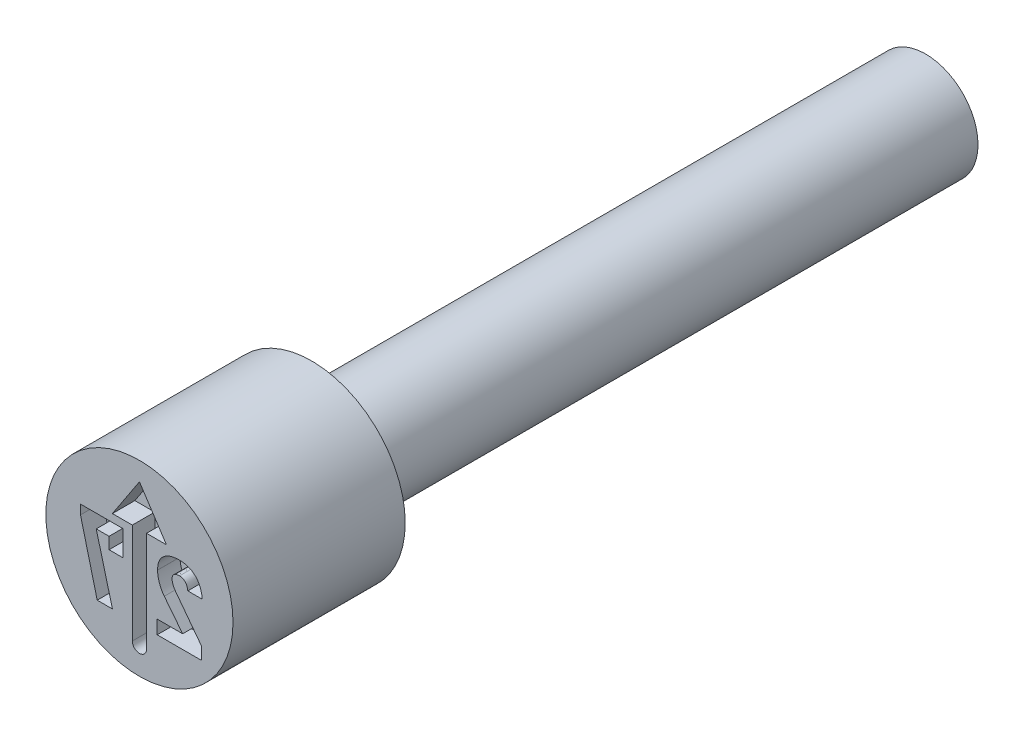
ISO-10303-21;
HEADER;
FILE_DESCRIPTION(('STEP AP214'),'2;1');
FILE_NAME('part.step','',(''),(''),'','','');
FILE_SCHEMA(('AUTOMOTIVE_DESIGN { 1 0 10303 214 1 1 1 1 }'));
ENDSEC;
DATA;
#1=APPLICATION_CONTEXT('core data for automotive mechanical design processes');
#2=APPLICATION_PROTOCOL_DEFINITION('international standard','automotive_design',2000,#1);
#3=PRODUCT_CONTEXT('',#1,'mechanical');
#4=PRODUCT('Part','Part','',(#3));
#5=PRODUCT_RELATED_PRODUCT_CATEGORY('part','',(#4));
#6=PRODUCT_DEFINITION_FORMATION('','',#4);
#7=PRODUCT_DEFINITION_CONTEXT('part definition',#1,'design');
#8=PRODUCT_DEFINITION('design','',#6,#7);
#9=PRODUCT_DEFINITION_SHAPE('','',#8);
#10=(LENGTH_UNIT() NAMED_UNIT(*) SI_UNIT(.MILLI.,.METRE.));
#11=(NAMED_UNIT(*) PLANE_ANGLE_UNIT() SI_UNIT($,.RADIAN.));
#12=(NAMED_UNIT(*) SI_UNIT($,.STERADIAN.) SOLID_ANGLE_UNIT());
#13=UNCERTAINTY_MEASURE_WITH_UNIT(LENGTH_MEASURE(1.E-05),#10,'distance_accuracy_value','');
#14=(GEOMETRIC_REPRESENTATION_CONTEXT(3) GLOBAL_UNCERTAINTY_ASSIGNED_CONTEXT((#13)) GLOBAL_UNIT_ASSIGNED_CONTEXT((#10,
#11,#12)) REPRESENTATION_CONTEXT('',''));
#15=CARTESIAN_POINT('',(0.,0.,0.));
#16=DIRECTION('',(0.,0.,1.));
#17=DIRECTION('',(1.,0.,0.));
#18=AXIS2_PLACEMENT_3D('',#15,#16,#17);
#19=CARTESIAN_POINT('',(0.,0.7,-2.3));
#20=DIRECTION('',(0.,0.,1.));
#21=DIRECTION('',(1.,0.,0.));
#22=AXIS2_PLACEMENT_3D('',#19,#20,#21);
#23=PLANE('',#22);
#24=CARTESIAN_POINT('',(0.,0.,-2.3));
#25=DIRECTION('',(0.,0.,1.));
#26=DIRECTION('',(1.,0.,0.));
#27=AXIS2_PLACEMENT_3D('',#24,#25,#26);
#28=CIRCLE('',#27,1.25);
#29=CARTESIAN_POINT('',(1.25,0.,-2.3));
#30=VERTEX_POINT('',#29);
#31=EDGE_CURVE('E11',#30,#30,#28,.T.);
#32=ORIENTED_EDGE('',*,*,#31,.F.);
#33=EDGE_LOOP('',(#32));
#34=FACE_BOUND('',#33,.T.);
#35=CARTESIAN_POINT('',(0.,0.,-2.3));
#36=DIRECTION('',(0.,0.,1.));
#37=DIRECTION('',(1.,0.,0.));
#38=AXIS2_PLACEMENT_3D('',#35,#36,#37);
#39=CIRCLE('',#38,0.7);
#40=CARTESIAN_POINT('',(0.7,0.,-2.3));
#41=VERTEX_POINT('',#40);
#42=EDGE_CURVE('E430',#41,#41,#39,.T.);
#43=ORIENTED_EDGE('',*,*,#42,.T.);
#44=EDGE_LOOP('',(#43));
#45=FACE_BOUND('',#44,.T.);
#46=ADVANCED_FACE('F39',(#34,#45),#23,.F.);
#47=CARTESIAN_POINT('',(0.,0.,-0.403888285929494));
#48=DIRECTION('',(0.,0.,1.));
#49=DIRECTION('',(1.,0.,0.));
#50=AXIS2_PLACEMENT_3D('',#47,#48,#49);
#51=CYLINDRICAL_SURFACE('',#50,1.25);
#52=CARTESIAN_POINT('',(0.,0.,0.));
#53=DIRECTION('',(0.,0.,1.));
#54=DIRECTION('',(1.,0.,0.));
#55=AXIS2_PLACEMENT_3D('',#52,#53,#54);
#56=CIRCLE('',#55,1.25);
#57=CARTESIAN_POINT('',(1.25,0.,0.));
#58=VERTEX_POINT('',#57);
#59=EDGE_CURVE('E46',#58,#58,#56,.T.);
#60=ORIENTED_EDGE('',*,*,#59,.F.);
#61=EDGE_LOOP('',(#60));
#62=FACE_BOUND('',#61,.T.);
#63=ORIENTED_EDGE('',*,*,#31,.T.);
#64=EDGE_LOOP('',(#63));
#65=FACE_BOUND('',#64,.T.);
#66=ADVANCED_FACE('F415',(#62,#65),#51,.T.);
#67=CARTESIAN_POINT('',(0.,1.25,0.));
#68=DIRECTION('',(0.,0.,-1.));
#69=DIRECTION('',(-1.,0.,0.));
#70=AXIS2_PLACEMENT_3D('',#67,#68,#69);
#71=PLANE('',#70);
#72=DIRECTION('',(0.,-1.,0.));
#73=VECTOR('',#72,1.);
#74=CARTESIAN_POINT('',(-0.787045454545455,0.35,0.));
#75=LINE('',#74,#73);
#76=CARTESIAN_POINT('',(-0.787045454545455,0.35,0.));
#77=VERTEX_POINT('',#76);
#78=CARTESIAN_POINT('',(-0.787045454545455,0.224594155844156,0.));
#79=VERTEX_POINT('',#78);
#80=EDGE_CURVE('E297',#77,#79,#75,.T.);
#81=ORIENTED_EDGE('',*,*,#80,.F.);
#82=DIRECTION('',(-1.,0.,0.));
#83=VECTOR('',#82,1.);
#84=CARTESIAN_POINT('',(-0.218051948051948,0.35,0.));
#85=LINE('',#84,#83);
#86=CARTESIAN_POINT('',(-0.218051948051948,0.35,0.));
#87=VERTEX_POINT('',#86);
#88=EDGE_CURVE('E53',#87,#77,#85,.T.);
#89=ORIENTED_EDGE('',*,*,#88,.F.);
#90=DIRECTION('',(0.,1.,0.));
#91=VECTOR('',#90,1.);
#92=CARTESIAN_POINT('',(-0.218051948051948,0.0123376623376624,0.));
#93=LINE('',#92,#91);
#94=CARTESIAN_POINT('',(-0.218051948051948,0.0123376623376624,0.));
#95=VERTEX_POINT('',#94);
#96=EDGE_CURVE('E274',#95,#87,#93,.T.);
#97=ORIENTED_EDGE('',*,*,#96,.F.);
#98=DIRECTION('',(1.,0.,0.));
#99=VECTOR('',#98,1.);
#100=CARTESIAN_POINT('',(-0.40575487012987,0.0123376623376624,0.));
#101=LINE('',#100,#99);
#102=CARTESIAN_POINT('',(-0.40575487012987,0.0123376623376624,0.));
#103=VERTEX_POINT('',#102);
#104=EDGE_CURVE('E277',#103,#95,#101,.T.);
#105=ORIENTED_EDGE('',*,*,#104,.F.);
#106=DIRECTION('',(0.,-1.,0.));
#107=VECTOR('',#106,1.);
#108=CARTESIAN_POINT('',(-0.40575487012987,0.168181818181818,0.));
#109=LINE('',#108,#107);
#110=CARTESIAN_POINT('',(-0.40575487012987,0.168181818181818,0.));
#111=VERTEX_POINT('',#110);
#112=EDGE_CURVE('E311',#111,#103,#109,.T.);
#113=ORIENTED_EDGE('',*,*,#112,.F.);
#114=DIRECTION('',(1.,0.,0.));
#115=VECTOR('',#114,1.);
#116=CARTESIAN_POINT('',(-0.576818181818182,0.168181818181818,0.));
#117=LINE('',#116,#115);
#118=CARTESIAN_POINT('',(-0.576818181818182,0.168181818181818,0.));
#119=VERTEX_POINT('',#118);
#120=EDGE_CURVE('E308',#119,#111,#117,.T.);
#121=ORIENTED_EDGE('',*,*,#120,.F.);
#122=DIRECTION('',(-0.255602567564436,0.966781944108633,0.));
#123=VECTOR('',#122,1.);
#124=CARTESIAN_POINT('',(-0.360503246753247,-0.65,0.));
#125=LINE('',#124,#123);
#126=CARTESIAN_POINT('',(-0.360503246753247,-0.65,0.));
#127=VERTEX_POINT('',#126);
#128=EDGE_CURVE('E305',#127,#119,#125,.T.);
#129=ORIENTED_EDGE('',*,*,#128,.F.);
#130=DIRECTION('',(1.,0.,0.));
#131=VECTOR('',#130,1.);
#132=CARTESIAN_POINT('',(-0.563831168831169,-0.65,0.));
#133=LINE('',#132,#131);
#134=CARTESIAN_POINT('',(-0.563831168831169,-0.65,0.));
#135=VERTEX_POINT('',#134);
#136=EDGE_CURVE('E302',#135,#127,#133,.T.);
#137=ORIENTED_EDGE('',*,*,#136,.F.);
#138=DIRECTION('',(0.247293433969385,-0.968940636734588,0.));
#139=VECTOR('',#138,1.);
#140=CARTESIAN_POINT('',(-0.787045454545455,0.224594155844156,0.));
#141=LINE('',#140,#139);
#142=EDGE_CURVE('E299',#79,#135,#141,.T.);
#143=ORIENTED_EDGE('',*,*,#142,.F.);
#144=EDGE_LOOP('',(#81,#89,#97,#105,#113,#121,#129,#137,#143));
#145=FACE_BOUND('',#144,.T.);
#146=DIRECTION('',(0.,1.,0.));
#147=VECTOR('',#146,1.);
#148=CARTESIAN_POINT('',(0.825933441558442,-0.65,0.));
#149=LINE('',#148,#147);
#150=CARTESIAN_POINT('',(0.825933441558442,-0.65,0.));
#151=VERTEX_POINT('',#150);
#152=CARTESIAN_POINT('',(0.825933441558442,-0.479951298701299,0.));
#153=VERTEX_POINT('',#152);
#154=EDGE_CURVE('E602',#151,#153,#149,.T.);
#155=ORIENTED_EDGE('',*,*,#154,.F.);
#156=DIRECTION('',(1.,0.,0.));
#157=VECTOR('',#156,1.);
#158=CARTESIAN_POINT('',(0.237053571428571,-0.65,0.));
#159=LINE('',#158,#157);
#160=CARTESIAN_POINT('',(0.237053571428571,-0.65,0.));
#161=VERTEX_POINT('',#160);
#162=EDGE_CURVE('E61',#161,#151,#159,.T.);
#163=ORIENTED_EDGE('',*,*,#162,.F.);
#164=DIRECTION('',(0.,-1.,0.));
#165=VECTOR('',#164,1.);
#166=CARTESIAN_POINT('',(0.237053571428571,-0.468181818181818,0.));
#167=LINE('',#166,#165);
#168=CARTESIAN_POINT('',(0.237053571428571,-0.468181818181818,0.));
#169=VERTEX_POINT('',#168);
#170=EDGE_CURVE('E335',#169,#161,#167,.T.);
#171=ORIENTED_EDGE('',*,*,#170,.F.);
#172=DIRECTION('',(-1.,0.,0.));
#173=VECTOR('',#172,1.);
#174=CARTESIAN_POINT('',(0.577353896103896,-0.468181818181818,0.));
#175=LINE('',#174,#173);
#176=CARTESIAN_POINT('',(0.577353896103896,-0.468181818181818,0.));
#177=VERTEX_POINT('',#176);
#178=EDGE_CURVE('E530',#177,#169,#175,.T.);
#179=ORIENTED_EDGE('',*,*,#178,.F.);
#180=DIRECTION('',(0.618183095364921,-0.78603413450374,0.));
#181=VECTOR('',#180,1.);
#182=CARTESIAN_POINT('',(0.332224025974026,-0.156493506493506,0.));
#183=LINE('',#182,#181);
#184=CARTESIAN_POINT('',(0.332224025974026,-0.156493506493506,0.));
#185=VERTEX_POINT('',#184);
#186=EDGE_CURVE('E533',#185,#177,#183,.T.);
#187=ORIENTED_EDGE('',*,*,#186,.F.);
#188=CARTESIAN_POINT('',(0.242532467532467,0.100811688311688,0.));
#189=CARTESIAN_POINT('',(0.242791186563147,0.0894335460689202,0.));
#190=CARTESIAN_POINT('',(0.24330908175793,0.0666571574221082,0.));
#191=CARTESIAN_POINT('',(0.247983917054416,0.0325691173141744,0.));
#192=CARTESIAN_POINT('',(0.255517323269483,-0.00134488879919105,0.));
#193=CARTESIAN_POINT('',(0.265863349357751,-0.0349210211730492,0.));
#194=CARTESIAN_POINT('',(0.278715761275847,-0.067577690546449,0.));
#195=CARTESIAN_POINT('',(0.294141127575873,-0.0988676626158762,0.));
#196=CARTESIAN_POINT('',(0.311550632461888,-0.128804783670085,0.));
#197=CARTESIAN_POINT('',(0.325346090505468,-0.147281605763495,0.));
#198=CARTESIAN_POINT('',(0.332224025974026,-0.156493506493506,0.));
#199=B_SPLINE_CURVE_WITH_KNOTS('',3,(#188,#189,#190,#191,#192,#193,#194,#195,#196,#197,#198),
.UNSPECIFIED.,.F.,.F.,(4,1,1,1,1,1,1,1,4),(0.,0.123046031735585,0.246309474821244,
0.371480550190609,0.498560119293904,0.626024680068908,0.750715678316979,0.875715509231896,1.),.UNSPECIFIED.);
#200=CARTESIAN_POINT('',(0.242532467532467,0.100811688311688,0.));
#201=VERTEX_POINT('',#200);
#202=EDGE_CURVE('E536',#201,#185,#199,.T.);
#203=ORIENTED_EDGE('',*,*,#202,.F.);
#204=DIRECTION('',(0.,-1.,0.));
#205=VECTOR('',#204,1.);
#206=CARTESIAN_POINT('',(0.242532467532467,0.101623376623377,0.));
#207=LINE('',#206,#205);
#208=CARTESIAN_POINT('',(0.242532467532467,0.101623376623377,0.));
#209=VERTEX_POINT('',#208);
#210=EDGE_CURVE('E541',#209,#201,#207,.T.);
#211=ORIENTED_EDGE('',*,*,#210,.F.);
#212=CARTESIAN_POINT('',(0.536972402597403,0.362987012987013,0.));
#213=CARTESIAN_POINT('',(0.525599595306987,0.362825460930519,0.));
#214=CARTESIAN_POINT('',(0.503480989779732,0.362511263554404,0.));
#215=CARTESIAN_POINT('',(0.471280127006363,0.359119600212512,0.));
#216=CARTESIAN_POINT('',(0.440982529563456,0.354000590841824,0.));
#217=CARTESIAN_POINT('',(0.412636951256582,0.346511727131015,0.));
#218=CARTESIAN_POINT('',(0.38635718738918,0.336743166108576,0.));
#219=CARTESIAN_POINT('',(0.36206451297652,0.324964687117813,0.));
#220=CARTESIAN_POINT('',(0.339708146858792,0.311075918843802,0.));
#221=CARTESIAN_POINT('',(0.319459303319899,0.295047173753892,0.));
#222=CARTESIAN_POINT('',(0.301240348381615,0.277169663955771,0.));
#223=CARTESIAN_POINT('',(0.285558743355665,0.257261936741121,0.));
#224=CARTESIAN_POINT('',(0.271983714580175,0.235726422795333,0.));
#225=CARTESIAN_POINT('',(0.261372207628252,0.212145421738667,0.));
#226=CARTESIAN_POINT('',(0.25263596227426,0.187073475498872,0.));
#227=CARTESIAN_POINT('',(0.246979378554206,0.160061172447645,0.));
#228=CARTESIAN_POINT('',(0.243167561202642,0.131426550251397,0.));
#229=CARTESIAN_POINT('',(0.242747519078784,0.111715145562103,0.));
#230=CARTESIAN_POINT('',(0.242532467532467,0.101623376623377,0.));
#231=B_SPLINE_CURVE_WITH_KNOTS('',3,(#212,#213,#214,#215,#216,#217,#218,#219,#220,#221,#222,
#223,#224,#225,#226,#227,#228,#229,#230),.UNSPECIFIED.,.F.,.F.,(4,1,1,1,1,1,1,1,1,1,1,1,1,1,1,1,
4),(0.,0.0762312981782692,0.148259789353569,0.216860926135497,0.28210063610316,
0.344528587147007,0.404571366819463,0.462840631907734,0.520642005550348,0.577409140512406,
0.633580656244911,0.690215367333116,0.747647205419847,0.806597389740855,0.867894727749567,
0.932365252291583,1.),.UNSPECIFIED.);
#232=CARTESIAN_POINT('',(0.536972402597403,0.362987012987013,0.));
#233=VERTEX_POINT('',#232);
#234=EDGE_CURVE('E547',#233,#209,#231,.T.);
#235=ORIENTED_EDGE('',*,*,#234,.F.);
#236=CARTESIAN_POINT('',(0.838311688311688,0.0628652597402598,0.));
#237=CARTESIAN_POINT('',(0.837362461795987,0.0744566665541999,0.));
#238=CARTESIAN_POINT('',(0.835509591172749,0.0970828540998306,0.));
#239=CARTESIAN_POINT('',(0.829435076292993,0.129812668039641,0.));
#240=CARTESIAN_POINT('',(0.821584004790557,0.16064191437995,0.));
#241=CARTESIAN_POINT('',(0.8115963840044,0.189564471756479,0.));
#242=CARTESIAN_POINT('',(0.798762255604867,0.21624544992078,0.));
#243=CARTESIAN_POINT('',(0.784342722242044,0.241242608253,0.));
#244=CARTESIAN_POINT('',(0.766999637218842,0.263782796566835,0.));
#245=CARTESIAN_POINT('',(0.748015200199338,0.284620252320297,0.));
#246=CARTESIAN_POINT('',(0.726869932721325,0.302973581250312,0.));
#247=CARTESIAN_POINT('',(0.704323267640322,0.319163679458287,0.));
#248=CARTESIAN_POINT('',(0.680034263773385,0.332636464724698,0.));
#249=CARTESIAN_POINT('',(0.654372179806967,0.343812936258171,0.));
#250=CARTESIAN_POINT('',(0.627052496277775,0.352295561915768,0.));
#251=CARTESIAN_POINT('',(0.598432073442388,0.358649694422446,0.));
#252=CARTESIAN_POINT('',(0.568182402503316,0.362314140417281,0.));
#253=CARTESIAN_POINT('',(0.547534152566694,0.362759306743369,0.));
#254=CARTESIAN_POINT('',(0.536972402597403,0.362987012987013,0.));
#255=B_SPLINE_CURVE_WITH_KNOTS('',3,(#236,#237,#238,#239,#240,#241,#242,#243,#244,#245,#246,
#247,#248,#249,#250,#251,#252,#253,#254),.UNSPECIFIED.,.F.,.F.,(4,1,1,1,1,1,1,1,1,1,1,1,1,1,1,1,
4),(0.,0.0733268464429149,0.143132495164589,0.209679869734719,0.273918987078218,
0.33576228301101,0.396210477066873,0.45560885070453,0.514796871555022,0.573764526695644,
0.631900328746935,0.689592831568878,0.748648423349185,0.808163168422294,0.86976604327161,
0.933384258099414,1.),.UNSPECIFIED.);
#256=CARTESIAN_POINT('',(0.838311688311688,0.0628652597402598,0.));
#257=VERTEX_POINT('',#256);
#258=EDGE_CURVE('E552',#257,#233,#255,.T.);
#259=ORIENTED_EDGE('',*,*,#258,.F.);
#260=DIRECTION('',(0.,1.,0.));
#261=VECTOR('',#260,1.);
#262=CARTESIAN_POINT('',(0.838311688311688,0.0622564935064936,0.));
#263=LINE('',#262,#261);
#264=CARTESIAN_POINT('',(0.838311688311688,0.0622564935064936,0.));
#265=VERTEX_POINT('',#264);
#266=EDGE_CURVE('E560',#265,#257,#263,.T.);
#267=ORIENTED_EDGE('',*,*,#266,.F.);
#268=DIRECTION('',(1.,0.,0.));
#269=VECTOR('',#268,1.);
#270=CARTESIAN_POINT('',(0.645941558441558,0.0622564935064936,0.));
#271=LINE('',#270,#269);
#272=CARTESIAN_POINT('',(0.645941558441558,0.0622564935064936,0.));
#273=VERTEX_POINT('',#272);
#274=EDGE_CURVE('E566',#273,#265,#271,.T.);
#275=ORIENTED_EDGE('',*,*,#274,.F.);
#276=DIRECTION('',(0.,-1.,0.));
#277=VECTOR('',#276,1.);
#278=CARTESIAN_POINT('',(0.645941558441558,0.0628652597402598,0.));
#279=LINE('',#278,#277);
#280=CARTESIAN_POINT('',(0.645941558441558,0.0628652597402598,0.));
#281=VERTEX_POINT('',#280);
#282=EDGE_CURVE('E569',#281,#273,#279,.T.);
#283=ORIENTED_EDGE('',*,*,#282,.F.);
#284=CARTESIAN_POINT('',(0.535551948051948,0.181168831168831,0.));
#285=CARTESIAN_POINT('',(0.542903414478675,0.180881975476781,0.));
#286=CARTESIAN_POINT('',(0.557187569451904,0.180324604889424,0.));
#287=CARTESIAN_POINT('',(0.577409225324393,0.174147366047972,0.));
#288=CARTESIAN_POINT('',(0.595630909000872,0.164457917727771,0.));
#289=CARTESIAN_POINT('',(0.611339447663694,0.150632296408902,0.));
#290=CARTESIAN_POINT('',(0.624347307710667,0.133273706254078,0.));
#291=CARTESIAN_POINT('',(0.63490444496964,0.112832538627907,0.));
#292=CARTESIAN_POINT('',(0.642074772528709,0.0889397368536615,0.));
#293=CARTESIAN_POINT('',(0.644611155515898,0.0718364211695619,0.));
#294=CARTESIAN_POINT('',(0.645941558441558,0.0628652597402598,0.));
#295=B_SPLINE_CURVE_WITH_KNOTS('',3,(#284,#285,#286,#287,#288,#289,#290,#291,#292,#293,#294),
.UNSPECIFIED.,.F.,.F.,(4,1,1,1,1,1,1,1,4),(0.,0.122603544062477,0.238222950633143,
0.350089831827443,0.465559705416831,0.58502806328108,0.711014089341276,0.848418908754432,1.),.UNSPECIFIED.);
#296=CARTESIAN_POINT('',(0.535551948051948,0.181168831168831,0.));
#297=VERTEX_POINT('',#296);
#298=EDGE_CURVE('E572',#297,#281,#295,.T.);
#299=ORIENTED_EDGE('',*,*,#298,.F.);
#300=CARTESIAN_POINT('',(0.435714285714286,0.0963474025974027,0.));
#301=CARTESIAN_POINT('',(0.435991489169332,0.102741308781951,0.));
#302=CARTESIAN_POINT('',(0.436522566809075,0.1149910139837,0.));
#303=CARTESIAN_POINT('',(0.441526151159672,0.132251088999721,0.));
#304=CARTESIAN_POINT('',(0.449726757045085,0.147281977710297,0.));
#305=CARTESIAN_POINT('',(0.461472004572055,0.159697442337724,0.));
#306=CARTESIAN_POINT('',(0.476093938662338,0.169517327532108,0.));
#307=CARTESIAN_POINT('',(0.493589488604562,0.17643778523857,0.));
#308=CARTESIAN_POINT('',(0.513729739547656,0.180406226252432,0.));
#309=CARTESIAN_POINT('',(0.528025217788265,0.180905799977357,0.));
#310=CARTESIAN_POINT('',(0.535551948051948,0.181168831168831,0.));
#311=B_SPLINE_CURVE_WITH_KNOTS('',3,(#300,#301,#302,#303,#304,#305,#306,#307,#308,#309,#310),
.UNSPECIFIED.,.F.,.F.,(4,1,1,1,1,1,1,1,4),(0.,0.128749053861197,0.246662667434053,
0.359069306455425,0.47107757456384,0.588039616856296,0.711712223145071,0.848213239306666,1.),.UNSPECIFIED.);
#312=CARTESIAN_POINT('',(0.435714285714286,0.0963474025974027,0.));
#313=VERTEX_POINT('',#312);
#314=EDGE_CURVE('E577',#313,#297,#311,.T.);
#315=ORIENTED_EDGE('',*,*,#314,.F.);
#316=DIRECTION('',(0.,1.,0.));
#317=VECTOR('',#316,1.);
#318=CARTESIAN_POINT('',(0.435714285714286,0.0949269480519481,0.));
#319=LINE('',#318,#317);
#320=CARTESIAN_POINT('',(0.435714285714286,0.0949269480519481,0.));
#321=VERTEX_POINT('',#320);
#322=EDGE_CURVE('E585',#321,#313,#319,.T.);
#323=ORIENTED_EDGE('',*,*,#322,.F.);
#324=CARTESIAN_POINT('',(0.484212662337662,-0.0272321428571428,0.));
#325=CARTESIAN_POINT('',(0.477055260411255,-0.0171469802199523,0.));
#326=CARTESIAN_POINT('',(0.463109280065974,0.00250365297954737,0.));
#327=CARTESIAN_POINT('',(0.450487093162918,0.029489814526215,0.));
#328=CARTESIAN_POINT('',(0.442623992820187,0.0506473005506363,0.));
#329=CARTESIAN_POINT('',(0.438876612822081,0.0659906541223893,0.));
#330=CARTESIAN_POINT('',(0.436203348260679,0.0806296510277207,0.));
#331=CARTESIAN_POINT('',(0.435874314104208,0.0902486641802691,0.));
#332=CARTESIAN_POINT('',(0.435714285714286,0.0949269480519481,0.));
#333=B_SPLINE_CURVE_WITH_KNOTS('',3,(#324,#325,#326,#327,#328,#329,#330,#331,#332),
.UNSPECIFIED.,.F.,.F.,(4,1,1,1,1,1,4),(0.,0.277375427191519,0.540457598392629,0.666416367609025,
0.784009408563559,0.894951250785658,1.),.UNSPECIFIED.);
#334=CARTESIAN_POINT('',(0.484212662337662,-0.0272321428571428,0.));
#335=VERTEX_POINT('',#334);
#336=EDGE_CURVE('E591',#335,#321,#333,.T.);
#337=ORIENTED_EDGE('',*,*,#336,.F.);
#338=DIRECTION('',(-0.602458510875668,0.798150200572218,0.));
#339=VECTOR('',#338,1.);
#340=CARTESIAN_POINT('',(0.825933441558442,-0.479951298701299,0.));
#341=LINE('',#340,#339);
#342=EDGE_CURVE('E596',#153,#335,#341,.T.);
#343=ORIENTED_EDGE('',*,*,#342,.F.);
#344=EDGE_LOOP('',(#155,#163,#171,#179,#187,#203,#211,#235,#259,#267,#275,#283,#299,#315,#323,
#337,#343));
#345=FACE_BOUND('',#344,.T.);
#346=DIRECTION('',(0.,1.,0.));
#347=VECTOR('',#346,1.);
#348=CARTESIAN_POINT('',(0.0952365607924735,0.453175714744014,0.));
#349=LINE('',#348,#347);
#350=CARTESIAN_POINT('',(0.0952365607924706,-0.888080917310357,0.));
#351=VERTEX_POINT('',#350);
#352=CARTESIAN_POINT('',(0.0952365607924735,0.453175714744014,0.));
#353=VERTEX_POINT('',#352);
#354=EDGE_CURVE('E469',#351,#353,#349,.T.);
#355=ORIENTED_EDGE('',*,*,#354,.F.);
#356=CARTESIAN_POINT('',(0.,-0.888080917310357,0.));
#357=DIRECTION('',(0.,0.,1.));
#358=DIRECTION('',(1.,0.,0.));
#359=AXIS2_PLACEMENT_3D('',#356,#357,#358);
#360=CIRCLE('',#359,0.0952365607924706);
#361=CARTESIAN_POINT('',(-0.0952365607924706,-0.888080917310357,0.));
#362=VERTEX_POINT('',#361);
#363=EDGE_CURVE('E472',#362,#351,#360,.T.);
#364=ORIENTED_EDGE('',*,*,#363,.F.);
#365=DIRECTION('',(0.,-1.,0.));
#366=VECTOR('',#365,1.);
#367=CARTESIAN_POINT('',(-0.0952365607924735,0.453175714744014,0.));
#368=LINE('',#367,#366);
#369=CARTESIAN_POINT('',(-0.0952365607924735,0.453175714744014,0.));
#370=VERTEX_POINT('',#369);
#371=EDGE_CURVE('E453',#370,#362,#368,.T.);
#372=ORIENTED_EDGE('',*,*,#371,.F.);
#373=DIRECTION('',(1.,0.,0.));
#374=VECTOR('',#373,1.);
#375=CARTESIAN_POINT('',(-0.360958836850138,0.453175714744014,0.));
#376=LINE('',#375,#374);
#377=CARTESIAN_POINT('',(-0.360958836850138,0.453175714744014,0.));
#378=VERTEX_POINT('',#377);
#379=EDGE_CURVE('E457',#378,#370,#376,.T.);
#380=ORIENTED_EDGE('',*,*,#379,.F.);
#381=DIRECTION('',(-0.550159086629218,-0.835059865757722,0.));
#382=VECTOR('',#381,1.);
#383=CARTESIAN_POINT('',(0.,1.00105767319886,0.));
#384=LINE('',#383,#382);
#385=CARTESIAN_POINT('',(0.,1.00105767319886,0.));
#386=VERTEX_POINT('',#385);
#387=EDGE_CURVE('E460',#386,#378,#384,.T.);
#388=ORIENTED_EDGE('',*,*,#387,.F.);
#389=DIRECTION('',(-0.550159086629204,0.835059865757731,0.));
#390=VECTOR('',#389,1.);
#391=CARTESIAN_POINT('',(0.,1.00105767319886,0.));
#392=LINE('',#391,#390);
#393=CARTESIAN_POINT('',(0.360958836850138,0.453175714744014,0.));
#394=VERTEX_POINT('',#393);
#395=EDGE_CURVE('E463',#394,#386,#392,.T.);
#396=ORIENTED_EDGE('',*,*,#395,.F.);
#397=DIRECTION('',(1.,0.,0.));
#398=VECTOR('',#397,1.);
#399=CARTESIAN_POINT('',(0.360958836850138,0.453175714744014,0.));
#400=LINE('',#399,#398);
#401=EDGE_CURVE('E466',#353,#394,#400,.T.);
#402=ORIENTED_EDGE('',*,*,#401,.F.);
#403=EDGE_LOOP('',(#355,#364,#372,#380,#388,#396,#402));
#404=FACE_BOUND('',#403,.T.);
#405=ORIENTED_EDGE('',*,*,#59,.T.);
#406=EDGE_LOOP('',(#405));
#407=FACE_BOUND('',#406,.T.);
#408=ADVANCED_FACE('F412',(#145,#345,#404,#407),#71,.F.);
#409=CARTESIAN_POINT('',(0.,0.,-10.5));
#410=DIRECTION('',(0.,0.,1.));
#411=DIRECTION('',(1.,0.,0.));
#412=AXIS2_PLACEMENT_3D('',#409,#410,#411);
#413=PLANE('',#412);
#414=CARTESIAN_POINT('',(0.,0.,-10.5));
#415=DIRECTION('',(0.,0.,1.));
#416=DIRECTION('',(1.,0.,0.));
#417=AXIS2_PLACEMENT_3D('',#414,#415,#416);
#418=CIRCLE('',#417,0.700000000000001);
#419=CARTESIAN_POINT('',(0.700000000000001,0.,-10.5));
#420=VERTEX_POINT('',#419);
#421=EDGE_CURVE('E431',#420,#420,#418,.T.);
#422=ORIENTED_EDGE('',*,*,#421,.F.);
#423=EDGE_LOOP('',(#422));
#424=FACE_BOUND('',#423,.T.);
#425=ADVANCED_FACE('F408',(#424),#413,.F.);
#426=CARTESIAN_POINT('',(0.,0.,-0.403888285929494));
#427=DIRECTION('',(0.,0.,1.));
#428=DIRECTION('',(1.,0.,0.));
#429=AXIS2_PLACEMENT_3D('',#426,#427,#428);
#430=CYLINDRICAL_SURFACE('',#429,0.7);
#431=ORIENTED_EDGE('',*,*,#42,.F.);
#432=EDGE_LOOP('',(#431));
#433=FACE_BOUND('',#432,.T.);
#434=ORIENTED_EDGE('',*,*,#421,.T.);
#435=EDGE_LOOP('',(#434));
#436=FACE_BOUND('',#435,.T.);
#437=ADVANCED_FACE('F404',(#433,#436),#430,.T.);
#438=CARTESIAN_POINT('',(0.,-0.888080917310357,-0.3));
#439=DIRECTION('',(0.,0.,1.));
#440=DIRECTION('',(1.,0.,0.));
#441=AXIS2_PLACEMENT_3D('',#438,#439,#440);
#442=CYLINDRICAL_SURFACE('',#441,0.0952365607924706);
#443=ORIENTED_EDGE('',*,*,#363,.T.);
#444=DIRECTION('',(0.,0.,1.));
#445=VECTOR('',#444,1.);
#446=CARTESIAN_POINT('',(0.0952365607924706,-0.888080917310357,-0.3));
#447=LINE('',#446,#445);
#448=CARTESIAN_POINT('',(0.0952365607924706,-0.888080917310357,-0.3));
#449=VERTEX_POINT('',#448);
#450=EDGE_CURVE('E439',#449,#351,#447,.T.);
#451=ORIENTED_EDGE('',*,*,#450,.F.);
#452=CARTESIAN_POINT('',(0.,-0.888080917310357,-0.3));
#453=DIRECTION('',(0.,0.,1.));
#454=DIRECTION('',(1.,0.,0.));
#455=AXIS2_PLACEMENT_3D('',#452,#453,#454);
#456=CIRCLE('',#455,0.0952365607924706);
#457=CARTESIAN_POINT('',(-0.0952365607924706,-0.888080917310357,-0.3));
#458=VERTEX_POINT('',#457);
#459=EDGE_CURVE('E456',#458,#449,#456,.T.);
#460=ORIENTED_EDGE('',*,*,#459,.F.);
#461=DIRECTION('',(0.,0.,1.));
#462=VECTOR('',#461,1.);
#463=CARTESIAN_POINT('',(-0.0952365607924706,-0.888080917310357,-0.3));
#464=LINE('',#463,#462);
#465=EDGE_CURVE('E432',#458,#362,#464,.T.);
#466=ORIENTED_EDGE('',*,*,#465,.T.);
#467=EDGE_LOOP('',(#443,#451,#460,#466));
#468=FACE_BOUND('',#467,.T.);
#469=ADVANCED_FACE('F382',(#468),#442,.F.);
#470=CARTESIAN_POINT('',(-0.0952365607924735,0.453175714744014,-0.3));
#471=DIRECTION('',(-1.,0.,0.));
#472=DIRECTION('',(0.,-1.,0.));
#473=AXIS2_PLACEMENT_3D('',#470,#471,#472);
#474=PLANE('',#473);
#475=ORIENTED_EDGE('',*,*,#371,.T.);
#476=ORIENTED_EDGE('',*,*,#465,.F.);
#477=DIRECTION('',(0.,-1.,0.));
#478=VECTOR('',#477,1.);
#479=CARTESIAN_POINT('',(-0.0952365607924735,0.453175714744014,-0.3));
#480=LINE('',#479,#478);
#481=CARTESIAN_POINT('',(-0.0952365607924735,0.453175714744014,-0.3));
#482=VERTEX_POINT('',#481);
#483=EDGE_CURVE('E444',#482,#458,#480,.T.);
#484=ORIENTED_EDGE('',*,*,#483,.F.);
#485=DIRECTION('',(0.,0.,1.));
#486=VECTOR('',#485,1.);
#487=CARTESIAN_POINT('',(-0.0952365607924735,0.453175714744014,-0.3));
#488=LINE('',#487,#486);
#489=EDGE_CURVE('E436',#482,#370,#488,.T.);
#490=ORIENTED_EDGE('',*,*,#489,.T.);
#491=EDGE_LOOP('',(#475,#476,#484,#490));
#492=FACE_BOUND('',#491,.T.);
#493=ADVANCED_FACE('F378',(#492),#474,.F.);
#494=CARTESIAN_POINT('',(-0.360958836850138,0.453175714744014,-0.3));
#495=DIRECTION('',(0.,-1.,0.));
#496=DIRECTION('',(0.,0.,-1.));
#497=AXIS2_PLACEMENT_3D('',#494,#495,#496);
#498=PLANE('',#497);
#499=ORIENTED_EDGE('',*,*,#379,.T.);
#500=ORIENTED_EDGE('',*,*,#489,.F.);
#501=DIRECTION('',(1.,0.,0.));
#502=VECTOR('',#501,1.);
#503=CARTESIAN_POINT('',(-0.360958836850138,0.453175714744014,-0.3));
#504=LINE('',#503,#502);
#505=CARTESIAN_POINT('',(-0.360958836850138,0.453175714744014,-0.3));
#506=VERTEX_POINT('',#505);
#507=EDGE_CURVE('E477',#506,#482,#504,.T.);
#508=ORIENTED_EDGE('',*,*,#507,.F.);
#509=DIRECTION('',(0.,0.,1.));
#510=VECTOR('',#509,1.);
#511=CARTESIAN_POINT('',(-0.360958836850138,0.453175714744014,-0.3));
#512=LINE('',#511,#510);
#513=EDGE_CURVE('E450',#506,#378,#512,.T.);
#514=ORIENTED_EDGE('',*,*,#513,.T.);
#515=EDGE_LOOP('',(#499,#500,#508,#514));
#516=FACE_BOUND('',#515,.T.);
#517=ADVANCED_FACE('F381',(#516),#498,.F.);
#518=CARTESIAN_POINT('',(0.,1.00105767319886,-0.3));
#519=DIRECTION('',(-0.835059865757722,0.550159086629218,0.));
#520=DIRECTION('',(-0.550159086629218,-0.835059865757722,0.));
#521=AXIS2_PLACEMENT_3D('',#518,#519,#520);
#522=PLANE('',#521);
#523=ORIENTED_EDGE('',*,*,#387,.T.);
#524=ORIENTED_EDGE('',*,*,#513,.F.);
#525=DIRECTION('',(-0.550159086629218,-0.835059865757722,0.));
#526=VECTOR('',#525,1.);
#527=CARTESIAN_POINT('',(0.,1.00105767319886,-0.3));
#528=LINE('',#527,#526);
#529=CARTESIAN_POINT('',(0.,1.00105767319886,-0.3));
#530=VERTEX_POINT('',#529);
#531=EDGE_CURVE('E480',#530,#506,#528,.T.);
#532=ORIENTED_EDGE('',*,*,#531,.F.);
#533=DIRECTION('',(0.,0.,1.));
#534=VECTOR('',#533,1.);
#535=CARTESIAN_POINT('',(0.,1.00105767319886,-0.3));
#536=LINE('',#535,#534);
#537=EDGE_CURVE('E448',#530,#386,#536,.T.);
#538=ORIENTED_EDGE('',*,*,#537,.T.);
#539=EDGE_LOOP('',(#523,#524,#532,#538));
#540=FACE_BOUND('',#539,.T.);
#541=ADVANCED_FACE('F386',(#540),#522,.F.);
#542=CARTESIAN_POINT('',(0.,1.00105767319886,-0.3));
#543=DIRECTION('',(0.835059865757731,0.550159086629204,0.));
#544=DIRECTION('',(-0.550159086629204,0.835059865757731,0.));
#545=AXIS2_PLACEMENT_3D('',#542,#543,#544);
#546=PLANE('',#545);
#547=ORIENTED_EDGE('',*,*,#395,.T.);
#548=ORIENTED_EDGE('',*,*,#537,.F.);
#549=DIRECTION('',(-0.550159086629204,0.835059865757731,0.));
#550=VECTOR('',#549,1.);
#551=CARTESIAN_POINT('',(0.,1.00105767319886,-0.3));
#552=LINE('',#551,#550);
#553=CARTESIAN_POINT('',(0.360958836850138,0.453175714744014,-0.3));
#554=VERTEX_POINT('',#553);
#555=EDGE_CURVE('E483',#554,#530,#552,.T.);
#556=ORIENTED_EDGE('',*,*,#555,.F.);
#557=DIRECTION('',(0.,0.,1.));
#558=VECTOR('',#557,1.);
#559=CARTESIAN_POINT('',(0.360958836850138,0.453175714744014,-0.3));
#560=LINE('',#559,#558);
#561=EDGE_CURVE('E446',#554,#394,#560,.T.);
#562=ORIENTED_EDGE('',*,*,#561,.T.);
#563=EDGE_LOOP('',(#547,#548,#556,#562));
#564=FACE_BOUND('',#563,.T.);
#565=ADVANCED_FACE('F390',(#564),#546,.F.);
#566=CARTESIAN_POINT('',(0.360958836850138,0.453175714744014,-0.3));
#567=DIRECTION('',(0.,-1.,0.));
#568=DIRECTION('',(0.,0.,-1.));
#569=AXIS2_PLACEMENT_3D('',#566,#567,#568);
#570=PLANE('',#569);
#571=ORIENTED_EDGE('',*,*,#401,.T.);
#572=ORIENTED_EDGE('',*,*,#561,.F.);
#573=DIRECTION('',(1.,0.,0.));
#574=VECTOR('',#573,1.);
#575=CARTESIAN_POINT('',(0.360958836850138,0.453175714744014,-0.3));
#576=LINE('',#575,#574);
#577=CARTESIAN_POINT('',(0.0952365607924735,0.453175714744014,-0.3));
#578=VERTEX_POINT('',#577);
#579=EDGE_CURVE('E486',#578,#554,#576,.T.);
#580=ORIENTED_EDGE('',*,*,#579,.F.);
#581=DIRECTION('',(0.,0.,1.));
#582=VECTOR('',#581,1.);
#583=CARTESIAN_POINT('',(0.0952365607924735,0.453175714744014,-0.3));
#584=LINE('',#583,#582);
#585=EDGE_CURVE('E443',#578,#353,#584,.T.);
#586=ORIENTED_EDGE('',*,*,#585,.T.);
#587=EDGE_LOOP('',(#571,#572,#580,#586));
#588=FACE_BOUND('',#587,.T.);
#589=ADVANCED_FACE('F394',(#588),#570,.F.);
#590=CARTESIAN_POINT('',(0.0952365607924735,0.453175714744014,-0.3));
#591=DIRECTION('',(1.,0.,0.));
#592=DIRECTION('',(0.,1.,0.));
#593=AXIS2_PLACEMENT_3D('',#590,#591,#592);
#594=PLANE('',#593);
#595=ORIENTED_EDGE('',*,*,#354,.T.);
#596=ORIENTED_EDGE('',*,*,#585,.F.);
#597=DIRECTION('',(0.,1.,0.));
#598=VECTOR('',#597,1.);
#599=CARTESIAN_POINT('',(0.0952365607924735,0.453175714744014,-0.3));
#600=LINE('',#599,#598);
#601=EDGE_CURVE('E489',#449,#578,#600,.T.);
#602=ORIENTED_EDGE('',*,*,#601,.F.);
#603=ORIENTED_EDGE('',*,*,#450,.T.);
#604=EDGE_LOOP('',(#595,#596,#602,#603));
#605=FACE_BOUND('',#604,.T.);
#606=ADVANCED_FACE('F376',(#605),#594,.F.);
#607=CARTESIAN_POINT('',(0.,-0.888080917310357,-0.3));
#608=DIRECTION('',(0.,0.,1.));
#609=DIRECTION('',(1.,0.,0.));
#610=AXIS2_PLACEMENT_3D('',#607,#608,#609);
#611=PLANE('',#610);
#612=ORIENTED_EDGE('',*,*,#459,.T.);
#613=ORIENTED_EDGE('',*,*,#601,.T.);
#614=ORIENTED_EDGE('',*,*,#579,.T.);
#615=ORIENTED_EDGE('',*,*,#555,.T.);
#616=ORIENTED_EDGE('',*,*,#531,.T.);
#617=ORIENTED_EDGE('',*,*,#507,.T.);
#618=ORIENTED_EDGE('',*,*,#483,.T.);
#619=EDGE_LOOP('',(#612,#613,#614,#615,#616,#617,#618));
#620=FACE_BOUND('',#619,.T.);
#621=ADVANCED_FACE('F373',(#620),#611,.T.);
#622=CARTESIAN_POINT('',(0.237053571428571,-0.65,-0.3));
#623=DIRECTION('',(0.,-1.,0.));
#624=DIRECTION('',(0.,0.,-1.));
#625=AXIS2_PLACEMENT_3D('',#622,#623,#624);
#626=PLANE('',#625);
#627=ORIENTED_EDGE('',*,*,#162,.T.);
#628=DIRECTION('',(0.,0.,1.));
#629=VECTOR('',#628,1.);
#630=CARTESIAN_POINT('',(0.825933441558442,-0.65,-0.3));
#631=LINE('',#630,#629);
#632=CARTESIAN_POINT('',(0.825933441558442,-0.65,-0.3));
#633=VERTEX_POINT('',#632);
#634=EDGE_CURVE('E494',#633,#151,#631,.T.);
#635=ORIENTED_EDGE('',*,*,#634,.F.);
#636=DIRECTION('',(1.,0.,0.));
#637=VECTOR('',#636,1.);
#638=CARTESIAN_POINT('',(0.237053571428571,-0.65,-0.3));
#639=LINE('',#638,#637);
#640=CARTESIAN_POINT('',(0.237053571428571,-0.65,-0.3));
#641=VERTEX_POINT('',#640);
#642=EDGE_CURVE('E331',#641,#633,#639,.T.);
#643=ORIENTED_EDGE('',*,*,#642,.F.);
#644=DIRECTION('',(0.,0.,1.));
#645=VECTOR('',#644,1.);
#646=CARTESIAN_POINT('',(0.237053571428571,-0.65,-0.3));
#647=LINE('',#646,#645);
#648=EDGE_CURVE('E474',#641,#161,#647,.T.);
#649=ORIENTED_EDGE('',*,*,#648,.T.);
#650=EDGE_LOOP('',(#627,#635,#643,#649));
#651=FACE_BOUND('',#650,.T.);
#652=ADVANCED_FACE('F369',(#651),#626,.F.);
#653=CARTESIAN_POINT('',(0.237053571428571,-0.468181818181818,-0.3));
#654=DIRECTION('',(-1.,0.,0.));
#655=DIRECTION('',(0.,0.,1.));
#656=AXIS2_PLACEMENT_3D('',#653,#654,#655);
#657=PLANE('',#656);
#658=ORIENTED_EDGE('',*,*,#170,.T.);
#659=ORIENTED_EDGE('',*,*,#648,.F.);
#660=DIRECTION('',(0.,-1.,0.));
#661=VECTOR('',#660,1.);
#662=CARTESIAN_POINT('',(0.237053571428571,-0.468181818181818,-0.3));
#663=LINE('',#662,#661);
#664=CARTESIAN_POINT('',(0.237053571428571,-0.468181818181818,-0.3));
#665=VERTEX_POINT('',#664);
#666=EDGE_CURVE('E497',#665,#641,#663,.T.);
#667=ORIENTED_EDGE('',*,*,#666,.F.);
#668=DIRECTION('',(0.,0.,1.));
#669=VECTOR('',#668,1.);
#670=CARTESIAN_POINT('',(0.237053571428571,-0.468181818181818,-0.3));
#671=LINE('',#670,#669);
#672=EDGE_CURVE('E525',#665,#169,#671,.T.);
#673=ORIENTED_EDGE('',*,*,#672,.T.);
#674=EDGE_LOOP('',(#658,#659,#667,#673));
#675=FACE_BOUND('',#674,.T.);
#676=ADVANCED_FACE('F372',(#675),#657,.F.);
#677=CARTESIAN_POINT('',(0.577353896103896,-0.468181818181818,-0.3));
#678=DIRECTION('',(0.,1.,0.));
#679=DIRECTION('',(0.,0.,1.));
#680=AXIS2_PLACEMENT_3D('',#677,#678,#679);
#681=PLANE('',#680);
#682=ORIENTED_EDGE('',*,*,#178,.T.);
#683=ORIENTED_EDGE('',*,*,#672,.F.);
#684=DIRECTION('',(-1.,0.,0.));
#685=VECTOR('',#684,1.);
#686=CARTESIAN_POINT('',(0.577353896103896,-0.468181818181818,-0.3));
#687=LINE('',#686,#685);
#688=CARTESIAN_POINT('',(0.577353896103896,-0.468181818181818,-0.3));
#689=VERTEX_POINT('',#688);
#690=EDGE_CURVE('E608',#689,#665,#687,.T.);
#691=ORIENTED_EDGE('',*,*,#690,.F.);
#692=DIRECTION('',(0.,0.,1.));
#693=VECTOR('',#692,1.);
#694=CARTESIAN_POINT('',(0.577353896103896,-0.468181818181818,-0.3));
#695=LINE('',#694,#693);
#696=EDGE_CURVE('E523',#689,#177,#695,.T.);
#697=ORIENTED_EDGE('',*,*,#696,.T.);
#698=EDGE_LOOP('',(#682,#683,#691,#697));
#699=FACE_BOUND('',#698,.T.);
#700=ADVANCED_FACE('F724',(#699),#681,.F.);
#701=CARTESIAN_POINT('',(0.332224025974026,-0.156493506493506,-0.3));
#702=DIRECTION('',(-0.786034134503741,-0.618183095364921,0.));
#703=DIRECTION('',(0.618183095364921,-0.78603413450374,0.));
#704=AXIS2_PLACEMENT_3D('',#701,#702,#703);
#705=PLANE('',#704);
#706=ORIENTED_EDGE('',*,*,#186,.T.);
#707=ORIENTED_EDGE('',*,*,#696,.F.);
#708=DIRECTION('',(0.618183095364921,-0.78603413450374,0.));
#709=VECTOR('',#708,1.);
#710=CARTESIAN_POINT('',(0.332224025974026,-0.156493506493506,-0.3));
#711=LINE('',#710,#709);
#712=CARTESIAN_POINT('',(0.332224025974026,-0.156493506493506,-0.3));
#713=VERTEX_POINT('',#712);
#714=EDGE_CURVE('E611',#713,#689,#711,.T.);
#715=ORIENTED_EDGE('',*,*,#714,.F.);
#716=DIRECTION('',(0.,0.,1.));
#717=VECTOR('',#716,1.);
#718=CARTESIAN_POINT('',(0.332224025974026,-0.156493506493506,-0.3));
#719=LINE('',#718,#717);
#720=EDGE_CURVE('E521',#713,#185,#719,.T.);
#721=ORIENTED_EDGE('',*,*,#720,.T.);
#722=EDGE_LOOP('',(#706,#707,#715,#721));
#723=FACE_BOUND('',#722,.T.);
#724=ADVANCED_FACE('F631',(#723),#705,.F.);
#725=CARTESIAN_POINT('',(0.242532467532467,0.100811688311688,-0.3));
#726=CARTESIAN_POINT('',(0.242791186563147,0.0894335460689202,-0.3));
#727=CARTESIAN_POINT('',(0.24330908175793,0.0666571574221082,-0.3));
#728=CARTESIAN_POINT('',(0.247983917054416,0.0325691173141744,-0.3));
#729=CARTESIAN_POINT('',(0.255517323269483,-0.00134488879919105,-0.3));
#730=CARTESIAN_POINT('',(0.265863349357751,-0.0349210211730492,-0.3));
#731=CARTESIAN_POINT('',(0.278715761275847,-0.067577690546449,-0.3));
#732=CARTESIAN_POINT('',(0.294141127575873,-0.0988676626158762,-0.3));
#733=CARTESIAN_POINT('',(0.311550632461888,-0.128804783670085,-0.3));
#734=CARTESIAN_POINT('',(0.325346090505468,-0.147281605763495,-0.3));
#735=CARTESIAN_POINT('',(0.332224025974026,-0.156493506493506,-0.3));
#736=B_SPLINE_CURVE_WITH_KNOTS('',3,(#725,#726,#727,#728,#729,#730,#731,#732,#733,#734,#735),
.UNSPECIFIED.,.F.,.F.,(4,1,1,1,1,1,1,1,4),(0.,0.123046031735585,0.246309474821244,
0.371480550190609,0.498560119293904,0.626024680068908,0.750715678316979,0.875715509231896,1.),.UNSPECIFIED.);
#737=DIRECTION('',(0.,0.,1.));
#738=VECTOR('',#737,1.);
#739=SURFACE_OF_LINEAR_EXTRUSION('',#736,#738);
#740=ORIENTED_EDGE('',*,*,#202,.T.);
#741=ORIENTED_EDGE('',*,*,#720,.F.);
#742=CARTESIAN_POINT('',(0.242532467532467,0.100811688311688,-0.3));
#743=VERTEX_POINT('',#742);
#744=EDGE_CURVE('E614',#743,#713,#736,.T.);
#745=ORIENTED_EDGE('',*,*,#744,.F.);
#746=DIRECTION('',(0.,0.,1.));
#747=VECTOR('',#746,1.);
#748=CARTESIAN_POINT('',(0.242532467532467,0.100811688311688,-0.3));
#749=LINE('',#748,#747);
#750=EDGE_CURVE('E519',#743,#201,#749,.T.);
#751=ORIENTED_EDGE('',*,*,#750,.T.);
#752=EDGE_LOOP('',(#740,#741,#745,#751));
#753=FACE_BOUND('',#752,.T.);
#754=ADVANCED_FACE('F626',(#753),#739,.F.);
#755=CARTESIAN_POINT('',(0.242532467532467,0.101623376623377,-0.3));
#756=DIRECTION('',(-1.,0.,0.));
#757=DIRECTION('',(0.,0.,1.));
#758=AXIS2_PLACEMENT_3D('',#755,#756,#757);
#759=PLANE('',#758);
#760=ORIENTED_EDGE('',*,*,#210,.T.);
#761=ORIENTED_EDGE('',*,*,#750,.F.);
#762=DIRECTION('',(0.,-1.,0.));
#763=VECTOR('',#762,1.);
#764=CARTESIAN_POINT('',(0.242532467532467,0.101623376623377,-0.3));
#765=LINE('',#764,#763);
#766=CARTESIAN_POINT('',(0.242532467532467,0.101623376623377,-0.3));
#767=VERTEX_POINT('',#766);
#768=EDGE_CURVE('E620',#767,#743,#765,.T.);
#769=ORIENTED_EDGE('',*,*,#768,.F.);
#770=DIRECTION('',(0.,0.,1.));
#771=VECTOR('',#770,1.);
#772=CARTESIAN_POINT('',(0.242532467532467,0.101623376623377,-0.3));
#773=LINE('',#772,#771);
#774=EDGE_CURVE('E517',#767,#209,#773,.T.);
#775=ORIENTED_EDGE('',*,*,#774,.T.);
#776=EDGE_LOOP('',(#760,#761,#769,#775));
#777=FACE_BOUND('',#776,.T.);
#778=ADVANCED_FACE('F630',(#777),#759,.F.);
#779=CARTESIAN_POINT('',(0.536972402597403,0.362987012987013,-0.3));
#780=CARTESIAN_POINT('',(0.525599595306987,0.362825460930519,-0.3));
#781=CARTESIAN_POINT('',(0.503480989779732,0.362511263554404,-0.3));
#782=CARTESIAN_POINT('',(0.471280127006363,0.359119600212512,-0.3));
#783=CARTESIAN_POINT('',(0.440982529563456,0.354000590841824,-0.3));
#784=CARTESIAN_POINT('',(0.412636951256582,0.346511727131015,-0.3));
#785=CARTESIAN_POINT('',(0.38635718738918,0.336743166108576,-0.3));
#786=CARTESIAN_POINT('',(0.36206451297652,0.324964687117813,-0.3));
#787=CARTESIAN_POINT('',(0.339708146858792,0.311075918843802,-0.3));
#788=CARTESIAN_POINT('',(0.319459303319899,0.295047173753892,-0.3));
#789=CARTESIAN_POINT('',(0.301240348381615,0.277169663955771,-0.3));
#790=CARTESIAN_POINT('',(0.285558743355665,0.257261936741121,-0.3));
#791=CARTESIAN_POINT('',(0.271983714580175,0.235726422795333,-0.3));
#792=CARTESIAN_POINT('',(0.261372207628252,0.212145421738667,-0.3));
#793=CARTESIAN_POINT('',(0.25263596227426,0.187073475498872,-0.3));
#794=CARTESIAN_POINT('',(0.246979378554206,0.160061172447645,-0.3));
#795=CARTESIAN_POINT('',(0.243167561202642,0.131426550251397,-0.3));
#796=CARTESIAN_POINT('',(0.242747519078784,0.111715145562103,-0.3));
#797=CARTESIAN_POINT('',(0.242532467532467,0.101623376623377,-0.3));
#798=B_SPLINE_CURVE_WITH_KNOTS('',3,(#779,#780,#781,#782,#783,#784,#785,#786,#787,#788,#789,
#790,#791,#792,#793,#794,#795,#796,#797),.UNSPECIFIED.,.F.,.F.,(4,1,1,1,1,1,1,1,1,1,1,1,1,1,1,1,
4),(0.,0.0762312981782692,0.148259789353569,0.216860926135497,0.28210063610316,
0.344528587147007,0.404571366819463,0.462840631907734,0.520642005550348,0.577409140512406,
0.633580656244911,0.690215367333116,0.747647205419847,0.806597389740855,0.867894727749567,
0.932365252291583,1.),.UNSPECIFIED.);
#799=DIRECTION('',(0.,0.,1.));
#800=VECTOR('',#799,1.);
#801=SURFACE_OF_LINEAR_EXTRUSION('',#798,#800);
#802=ORIENTED_EDGE('',*,*,#234,.T.);
#803=ORIENTED_EDGE('',*,*,#774,.F.);
#804=CARTESIAN_POINT('',(0.536972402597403,0.362987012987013,-0.3));
#805=VERTEX_POINT('',#804);
#806=EDGE_CURVE('E644',#805,#767,#798,.T.);
#807=ORIENTED_EDGE('',*,*,#806,.F.);
#808=DIRECTION('',(0.,0.,1.));
#809=VECTOR('',#808,1.);
#810=CARTESIAN_POINT('',(0.536972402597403,0.362987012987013,-0.3));
#811=LINE('',#810,#809);
#812=EDGE_CURVE('E515',#805,#233,#811,.T.);
#813=ORIENTED_EDGE('',*,*,#812,.T.);
#814=EDGE_LOOP('',(#802,#803,#807,#813));
#815=FACE_BOUND('',#814,.T.);
#816=ADVANCED_FACE('F636',(#815),#801,.F.);
#817=CARTESIAN_POINT('',(0.838311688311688,0.0628652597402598,-0.3));
#818=CARTESIAN_POINT('',(0.837362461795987,0.0744566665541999,-0.3));
#819=CARTESIAN_POINT('',(0.835509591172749,0.0970828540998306,-0.3));
#820=CARTESIAN_POINT('',(0.829435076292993,0.129812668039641,-0.3));
#821=CARTESIAN_POINT('',(0.821584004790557,0.16064191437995,-0.3));
#822=CARTESIAN_POINT('',(0.8115963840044,0.189564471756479,-0.3));
#823=CARTESIAN_POINT('',(0.798762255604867,0.21624544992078,-0.3));
#824=CARTESIAN_POINT('',(0.784342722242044,0.241242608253,-0.3));
#825=CARTESIAN_POINT('',(0.766999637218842,0.263782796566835,-0.3));
#826=CARTESIAN_POINT('',(0.748015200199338,0.284620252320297,-0.3));
#827=CARTESIAN_POINT('',(0.726869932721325,0.302973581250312,-0.3));
#828=CARTESIAN_POINT('',(0.704323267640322,0.319163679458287,-0.3));
#829=CARTESIAN_POINT('',(0.680034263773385,0.332636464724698,-0.3));
#830=CARTESIAN_POINT('',(0.654372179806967,0.343812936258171,-0.3));
#831=CARTESIAN_POINT('',(0.627052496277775,0.352295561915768,-0.3));
#832=CARTESIAN_POINT('',(0.598432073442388,0.358649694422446,-0.3));
#833=CARTESIAN_POINT('',(0.568182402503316,0.362314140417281,-0.3));
#834=CARTESIAN_POINT('',(0.547534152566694,0.362759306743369,-0.3));
#835=CARTESIAN_POINT('',(0.536972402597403,0.362987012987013,-0.3));
#836=B_SPLINE_CURVE_WITH_KNOTS('',3,(#817,#818,#819,#820,#821,#822,#823,#824,#825,#826,#827,
#828,#829,#830,#831,#832,#833,#834,#835),.UNSPECIFIED.,.F.,.F.,(4,1,1,1,1,1,1,1,1,1,1,1,1,1,1,1,
4),(0.,0.0733268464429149,0.143132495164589,0.209679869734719,0.273918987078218,
0.33576228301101,0.396210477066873,0.45560885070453,0.514796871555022,0.573764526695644,
0.631900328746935,0.689592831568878,0.748648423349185,0.808163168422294,0.86976604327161,
0.933384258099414,1.),.UNSPECIFIED.);
#837=DIRECTION('',(0.,0.,1.));
#838=VECTOR('',#837,1.);
#839=SURFACE_OF_LINEAR_EXTRUSION('',#836,#838);
#840=ORIENTED_EDGE('',*,*,#258,.T.);
#841=ORIENTED_EDGE('',*,*,#812,.F.);
#842=CARTESIAN_POINT('',(0.838311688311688,0.0628652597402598,-0.3));
#843=VERTEX_POINT('',#842);
#844=EDGE_CURVE('E649',#843,#805,#836,.T.);
#845=ORIENTED_EDGE('',*,*,#844,.F.);
#846=DIRECTION('',(0.,0.,1.));
#847=VECTOR('',#846,1.);
#848=CARTESIAN_POINT('',(0.838311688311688,0.0628652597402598,-0.3));
#849=LINE('',#848,#847);
#850=EDGE_CURVE('E513',#843,#257,#849,.T.);
#851=ORIENTED_EDGE('',*,*,#850,.T.);
#852=EDGE_LOOP('',(#840,#841,#845,#851));
#853=FACE_BOUND('',#852,.T.);
#854=ADVANCED_FACE('F640',(#853),#839,.F.);
#855=CARTESIAN_POINT('',(0.838311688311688,0.0622564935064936,-0.3));
#856=DIRECTION('',(1.,0.,0.));
#857=DIRECTION('',(0.,0.,-1.));
#858=AXIS2_PLACEMENT_3D('',#855,#856,#857);
#859=PLANE('',#858);
#860=ORIENTED_EDGE('',*,*,#266,.T.);
#861=ORIENTED_EDGE('',*,*,#850,.F.);
#862=DIRECTION('',(0.,1.,0.));
#863=VECTOR('',#862,1.);
#864=CARTESIAN_POINT('',(0.838311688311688,0.0622564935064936,-0.3));
#865=LINE('',#864,#863);
#866=CARTESIAN_POINT('',(0.838311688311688,0.0622564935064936,-0.3));
#867=VERTEX_POINT('',#866);
#868=EDGE_CURVE('E658',#867,#843,#865,.T.);
#869=ORIENTED_EDGE('',*,*,#868,.F.);
#870=DIRECTION('',(0.,0.,1.));
#871=VECTOR('',#870,1.);
#872=CARTESIAN_POINT('',(0.838311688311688,0.0622564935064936,-0.3));
#873=LINE('',#872,#871);
#874=EDGE_CURVE('E511',#867,#265,#873,.T.);
#875=ORIENTED_EDGE('',*,*,#874,.T.);
#876=EDGE_LOOP('',(#860,#861,#869,#875));
#877=FACE_BOUND('',#876,.T.);
#878=ADVANCED_FACE('F740',(#877),#859,.F.);
#879=CARTESIAN_POINT('',(0.645941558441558,0.0622564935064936,-0.3));
#880=DIRECTION('',(0.,-1.,0.));
#881=DIRECTION('',(0.,0.,-1.));
#882=AXIS2_PLACEMENT_3D('',#879,#880,#881);
#883=PLANE('',#882);
#884=ORIENTED_EDGE('',*,*,#274,.T.);
#885=ORIENTED_EDGE('',*,*,#874,.F.);
#886=DIRECTION('',(1.,0.,0.));
#887=VECTOR('',#886,1.);
#888=CARTESIAN_POINT('',(0.645941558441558,0.0622564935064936,-0.3));
#889=LINE('',#888,#887);
#890=CARTESIAN_POINT('',(0.645941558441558,0.0622564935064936,-0.3));
#891=VERTEX_POINT('',#890);
#892=EDGE_CURVE('E664',#891,#867,#889,.T.);
#893=ORIENTED_EDGE('',*,*,#892,.F.);
#894=DIRECTION('',(0.,0.,1.));
#895=VECTOR('',#894,1.);
#896=CARTESIAN_POINT('',(0.645941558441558,0.0622564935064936,-0.3));
#897=LINE('',#896,#895);
#898=EDGE_CURVE('E509',#891,#273,#897,.T.);
#899=ORIENTED_EDGE('',*,*,#898,.T.);
#900=EDGE_LOOP('',(#884,#885,#893,#899));
#901=FACE_BOUND('',#900,.T.);
#902=ADVANCED_FACE('F743',(#901),#883,.F.);
#903=CARTESIAN_POINT('',(0.645941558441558,0.0628652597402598,-0.3));
#904=DIRECTION('',(-1.,0.,0.));
#905=DIRECTION('',(0.,0.,1.));
#906=AXIS2_PLACEMENT_3D('',#903,#904,#905);
#907=PLANE('',#906);
#908=ORIENTED_EDGE('',*,*,#282,.T.);
#909=ORIENTED_EDGE('',*,*,#898,.F.);
#910=DIRECTION('',(0.,-1.,0.));
#911=VECTOR('',#910,1.);
#912=CARTESIAN_POINT('',(0.645941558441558,0.0628652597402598,-0.3));
#913=LINE('',#912,#911);
#914=CARTESIAN_POINT('',(0.645941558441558,0.0628652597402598,-0.3));
#915=VERTEX_POINT('',#914);
#916=EDGE_CURVE('E667',#915,#891,#913,.T.);
#917=ORIENTED_EDGE('',*,*,#916,.F.);
#918=DIRECTION('',(0.,0.,1.));
#919=VECTOR('',#918,1.);
#920=CARTESIAN_POINT('',(0.645941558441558,0.0628652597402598,-0.3));
#921=LINE('',#920,#919);
#922=EDGE_CURVE('E507',#915,#281,#921,.T.);
#923=ORIENTED_EDGE('',*,*,#922,.T.);
#924=EDGE_LOOP('',(#908,#909,#917,#923));
#925=FACE_BOUND('',#924,.T.);
#926=ADVANCED_FACE('F687',(#925),#907,.F.);
#927=CARTESIAN_POINT('',(0.535551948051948,0.181168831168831,-0.3));
#928=CARTESIAN_POINT('',(0.542903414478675,0.180881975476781,-0.3));
#929=CARTESIAN_POINT('',(0.557187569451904,0.180324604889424,-0.3));
#930=CARTESIAN_POINT('',(0.577409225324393,0.174147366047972,-0.3));
#931=CARTESIAN_POINT('',(0.595630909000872,0.164457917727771,-0.3));
#932=CARTESIAN_POINT('',(0.611339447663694,0.150632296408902,-0.3));
#933=CARTESIAN_POINT('',(0.624347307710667,0.133273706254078,-0.3));
#934=CARTESIAN_POINT('',(0.63490444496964,0.112832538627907,-0.3));
#935=CARTESIAN_POINT('',(0.642074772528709,0.0889397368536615,-0.3));
#936=CARTESIAN_POINT('',(0.644611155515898,0.0718364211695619,-0.3));
#937=CARTESIAN_POINT('',(0.645941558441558,0.0628652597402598,-0.3));
#938=B_SPLINE_CURVE_WITH_KNOTS('',3,(#927,#928,#929,#930,#931,#932,#933,#934,#935,#936,#937),
.UNSPECIFIED.,.F.,.F.,(4,1,1,1,1,1,1,1,4),(0.,0.122603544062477,0.238222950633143,
0.350089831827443,0.465559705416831,0.58502806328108,0.711014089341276,0.848418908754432,1.),.UNSPECIFIED.);
#939=DIRECTION('',(0.,0.,1.));
#940=VECTOR('',#939,1.);
#941=SURFACE_OF_LINEAR_EXTRUSION('',#938,#940);
#942=ORIENTED_EDGE('',*,*,#298,.T.);
#943=ORIENTED_EDGE('',*,*,#922,.F.);
#944=CARTESIAN_POINT('',(0.535551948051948,0.181168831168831,-0.3));
#945=VERTEX_POINT('',#944);
#946=EDGE_CURVE('E670',#945,#915,#938,.T.);
#947=ORIENTED_EDGE('',*,*,#946,.F.);
#948=DIRECTION('',(0.,0.,1.));
#949=VECTOR('',#948,1.);
#950=CARTESIAN_POINT('',(0.535551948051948,0.181168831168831,-0.3));
#951=LINE('',#950,#949);
#952=EDGE_CURVE('E505',#945,#297,#951,.T.);
#953=ORIENTED_EDGE('',*,*,#952,.T.);
#954=EDGE_LOOP('',(#942,#943,#947,#953));
#955=FACE_BOUND('',#954,.T.);
#956=ADVANCED_FACE('F683',(#955),#941,.F.);
#957=CARTESIAN_POINT('',(0.435714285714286,0.0963474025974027,-0.3));
#958=CARTESIAN_POINT('',(0.435991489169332,0.102741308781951,-0.3));
#959=CARTESIAN_POINT('',(0.436522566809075,0.1149910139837,-0.3));
#960=CARTESIAN_POINT('',(0.441526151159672,0.132251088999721,-0.3));
#961=CARTESIAN_POINT('',(0.449726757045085,0.147281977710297,-0.3));
#962=CARTESIAN_POINT('',(0.461472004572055,0.159697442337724,-0.3));
#963=CARTESIAN_POINT('',(0.476093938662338,0.169517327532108,-0.3));
#964=CARTESIAN_POINT('',(0.493589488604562,0.17643778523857,-0.3));
#965=CARTESIAN_POINT('',(0.513729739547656,0.180406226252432,-0.3));
#966=CARTESIAN_POINT('',(0.528025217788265,0.180905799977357,-0.3));
#967=CARTESIAN_POINT('',(0.535551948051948,0.181168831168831,-0.3));
#968=B_SPLINE_CURVE_WITH_KNOTS('',3,(#957,#958,#959,#960,#961,#962,#963,#964,#965,#966,#967),
.UNSPECIFIED.,.F.,.F.,(4,1,1,1,1,1,1,1,4),(0.,0.128749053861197,0.246662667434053,
0.359069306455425,0.47107757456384,0.588039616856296,0.711712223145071,0.848213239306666,1.),.UNSPECIFIED.);
#969=DIRECTION('',(0.,0.,1.));
#970=VECTOR('',#969,1.);
#971=SURFACE_OF_LINEAR_EXTRUSION('',#968,#970);
#972=ORIENTED_EDGE('',*,*,#314,.T.);
#973=ORIENTED_EDGE('',*,*,#952,.F.);
#974=CARTESIAN_POINT('',(0.435714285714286,0.0963474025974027,-0.3));
#975=VERTEX_POINT('',#974);
#976=EDGE_CURVE('E675',#975,#945,#968,.T.);
#977=ORIENTED_EDGE('',*,*,#976,.F.);
#978=DIRECTION('',(0.,0.,1.));
#979=VECTOR('',#978,1.);
#980=CARTESIAN_POINT('',(0.435714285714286,0.0963474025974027,-0.3));
#981=LINE('',#980,#979);
#982=EDGE_CURVE('E503',#975,#313,#981,.T.);
#983=ORIENTED_EDGE('',*,*,#982,.T.);
#984=EDGE_LOOP('',(#972,#973,#977,#983));
#985=FACE_BOUND('',#984,.T.);
#986=ADVANCED_FACE('F686',(#985),#971,.F.);
#987=CARTESIAN_POINT('',(0.435714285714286,0.0949269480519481,-0.3));
#988=DIRECTION('',(1.,0.,0.));
#989=DIRECTION('',(0.,0.,-1.));
#990=AXIS2_PLACEMENT_3D('',#987,#988,#989);
#991=PLANE('',#990);
#992=ORIENTED_EDGE('',*,*,#322,.T.);
#993=ORIENTED_EDGE('',*,*,#982,.F.);
#994=DIRECTION('',(0.,1.,0.));
#995=VECTOR('',#994,1.);
#996=CARTESIAN_POINT('',(0.435714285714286,0.0949269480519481,-0.3));
#997=LINE('',#996,#995);
#998=CARTESIAN_POINT('',(0.435714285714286,0.0949269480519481,-0.3));
#999=VERTEX_POINT('',#998);
#1000=EDGE_CURVE('E347',#999,#975,#997,.T.);
#1001=ORIENTED_EDGE('',*,*,#1000,.F.);
#1002=DIRECTION('',(0.,0.,1.));
#1003=VECTOR('',#1002,1.);
#1004=CARTESIAN_POINT('',(0.435714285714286,0.0949269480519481,-0.3));
#1005=LINE('',#1004,#1003);
#1006=EDGE_CURVE('E501',#999,#321,#1005,.T.);
#1007=ORIENTED_EDGE('',*,*,#1006,.T.);
#1008=EDGE_LOOP('',(#992,#993,#1001,#1007));
#1009=FACE_BOUND('',#1008,.T.);
#1010=ADVANCED_FACE('F358',(#1009),#991,.F.);
#1011=CARTESIAN_POINT('',(0.484212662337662,-0.0272321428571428,-0.3));
#1012=CARTESIAN_POINT('',(0.477055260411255,-0.0171469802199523,-0.3));
#1013=CARTESIAN_POINT('',(0.463109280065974,0.00250365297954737,-0.3));
#1014=CARTESIAN_POINT('',(0.450487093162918,0.029489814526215,-0.3));
#1015=CARTESIAN_POINT('',(0.442623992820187,0.0506473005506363,-0.3));
#1016=CARTESIAN_POINT('',(0.438876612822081,0.0659906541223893,-0.3));
#1017=CARTESIAN_POINT('',(0.436203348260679,0.0806296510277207,-0.3));
#1018=CARTESIAN_POINT('',(0.435874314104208,0.0902486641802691,-0.3));
#1019=CARTESIAN_POINT('',(0.435714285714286,0.0949269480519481,-0.3));
#1020=B_SPLINE_CURVE_WITH_KNOTS('',3,(#1011,#1012,#1013,#1014,#1015,#1016,#1017,#1018,#1019),
.UNSPECIFIED.,.F.,.F.,(4,1,1,1,1,1,4),(0.,0.277375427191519,0.540457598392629,0.666416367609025,
0.784009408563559,0.894951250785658,1.),.UNSPECIFIED.);
#1021=DIRECTION('',(0.,0.,1.));
#1022=VECTOR('',#1021,1.);
#1023=SURFACE_OF_LINEAR_EXTRUSION('',#1020,#1022);
#1024=ORIENTED_EDGE('',*,*,#336,.T.);
#1025=ORIENTED_EDGE('',*,*,#1006,.F.);
#1026=CARTESIAN_POINT('',(0.484212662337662,-0.0272321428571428,-0.3));
#1027=VERTEX_POINT('',#1026);
#1028=EDGE_CURVE('E341',#1027,#999,#1020,.T.);
#1029=ORIENTED_EDGE('',*,*,#1028,.F.);
#1030=DIRECTION('',(0.,0.,1.));
#1031=VECTOR('',#1030,1.);
#1032=CARTESIAN_POINT('',(0.484212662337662,-0.0272321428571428,-0.3));
#1033=LINE('',#1032,#1031);
#1034=EDGE_CURVE('E499',#1027,#335,#1033,.T.);
#1035=ORIENTED_EDGE('',*,*,#1034,.T.);
#1036=EDGE_LOOP('',(#1024,#1025,#1029,#1035));
#1037=FACE_BOUND('',#1036,.T.);
#1038=ADVANCED_FACE('F353',(#1037),#1023,.F.);
#1039=CARTESIAN_POINT('',(0.825933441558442,-0.479951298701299,-0.3));
#1040=DIRECTION('',(0.798150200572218,0.602458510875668,0.));
#1041=DIRECTION('',(-0.602458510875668,0.798150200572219,0.));
#1042=AXIS2_PLACEMENT_3D('',#1039,#1040,#1041);
#1043=PLANE('',#1042);
#1044=ORIENTED_EDGE('',*,*,#342,.T.);
#1045=ORIENTED_EDGE('',*,*,#1034,.F.);
#1046=DIRECTION('',(-0.602458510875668,0.798150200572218,0.));
#1047=VECTOR('',#1046,1.);
#1048=CARTESIAN_POINT('',(0.825933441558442,-0.479951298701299,-0.3));
#1049=LINE('',#1048,#1047);
#1050=CARTESIAN_POINT('',(0.825933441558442,-0.479951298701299,-0.3));
#1051=VERTEX_POINT('',#1050);
#1052=EDGE_CURVE('E338',#1051,#1027,#1049,.T.);
#1053=ORIENTED_EDGE('',*,*,#1052,.F.);
#1054=DIRECTION('',(0.,0.,1.));
#1055=VECTOR('',#1054,1.);
#1056=CARTESIAN_POINT('',(0.825933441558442,-0.479951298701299,-0.3));
#1057=LINE('',#1056,#1055);
#1058=EDGE_CURVE('E496',#1051,#153,#1057,.T.);
#1059=ORIENTED_EDGE('',*,*,#1058,.T.);
#1060=EDGE_LOOP('',(#1044,#1045,#1053,#1059));
#1061=FACE_BOUND('',#1060,.T.);
#1062=ADVANCED_FACE('F357',(#1061),#1043,.F.);
#1063=CARTESIAN_POINT('',(0.825933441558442,-0.65,-0.3));
#1064=DIRECTION('',(1.,0.,0.));
#1065=DIRECTION('',(0.,0.,-1.));
#1066=AXIS2_PLACEMENT_3D('',#1063,#1064,#1065);
#1067=PLANE('',#1066);
#1068=ORIENTED_EDGE('',*,*,#154,.T.);
#1069=ORIENTED_EDGE('',*,*,#1058,.F.);
#1070=DIRECTION('',(0.,1.,0.));
#1071=VECTOR('',#1070,1.);
#1072=CARTESIAN_POINT('',(0.825933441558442,-0.65,-0.3));
#1073=LINE('',#1072,#1071);
#1074=EDGE_CURVE('E334',#633,#1051,#1073,.T.);
#1075=ORIENTED_EDGE('',*,*,#1074,.F.);
#1076=ORIENTED_EDGE('',*,*,#634,.T.);
#1077=EDGE_LOOP('',(#1068,#1069,#1075,#1076));
#1078=FACE_BOUND('',#1077,.T.);
#1079=ADVANCED_FACE('F363',(#1078),#1067,.F.);
#1080=CARTESIAN_POINT('',(0.450560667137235,0.0302660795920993,-0.3));
#1081=DIRECTION('',(0.,0.,1.));
#1082=DIRECTION('',(1.,0.,0.));
#1083=AXIS2_PLACEMENT_3D('',#1080,#1081,#1082);
#1084=PLANE('',#1083);
#1085=ORIENTED_EDGE('',*,*,#642,.T.);
#1086=ORIENTED_EDGE('',*,*,#1074,.T.);
#1087=ORIENTED_EDGE('',*,*,#1052,.T.);
#1088=ORIENTED_EDGE('',*,*,#1028,.T.);
#1089=ORIENTED_EDGE('',*,*,#1000,.T.);
#1090=ORIENTED_EDGE('',*,*,#976,.T.);
#1091=ORIENTED_EDGE('',*,*,#946,.T.);
#1092=ORIENTED_EDGE('',*,*,#916,.T.);
#1093=ORIENTED_EDGE('',*,*,#892,.T.);
#1094=ORIENTED_EDGE('',*,*,#868,.T.);
#1095=ORIENTED_EDGE('',*,*,#844,.T.);
#1096=ORIENTED_EDGE('',*,*,#806,.T.);
#1097=ORIENTED_EDGE('',*,*,#768,.T.);
#1098=ORIENTED_EDGE('',*,*,#744,.T.);
#1099=ORIENTED_EDGE('',*,*,#714,.T.);
#1100=ORIENTED_EDGE('',*,*,#690,.T.);
#1101=ORIENTED_EDGE('',*,*,#666,.T.);
#1102=EDGE_LOOP('',(#1085,#1086,#1087,#1088,#1089,#1090,#1091,#1092,#1093,#1094,#1095,#1096,
#1097,#1098,#1099,#1100,#1101));
#1103=FACE_BOUND('',#1102,.T.);
#1104=ADVANCED_FACE('F367',(#1103),#1084,.T.);
#1105=CARTESIAN_POINT('',(-0.218051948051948,0.35,-0.3));
#1106=DIRECTION('',(0.,1.,0.));
#1107=DIRECTION('',(0.,0.,1.));
#1108=AXIS2_PLACEMENT_3D('',#1105,#1106,#1107);
#1109=PLANE('',#1108);
#1110=ORIENTED_EDGE('',*,*,#88,.T.);
#1111=DIRECTION('',(0.,0.,1.));
#1112=VECTOR('',#1111,1.);
#1113=CARTESIAN_POINT('',(-0.787045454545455,0.35,-0.3));
#1114=LINE('',#1113,#1112);
#1115=CARTESIAN_POINT('',(-0.787045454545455,0.35,-0.3));
#1116=VERTEX_POINT('',#1115);
#1117=EDGE_CURVE('E251',#1116,#77,#1114,.T.);
#1118=ORIENTED_EDGE('',*,*,#1117,.F.);
#1119=DIRECTION('',(-1.,0.,0.));
#1120=VECTOR('',#1119,1.);
#1121=CARTESIAN_POINT('',(-0.218051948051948,0.35,-0.3));
#1122=LINE('',#1121,#1120);
#1123=CARTESIAN_POINT('',(-0.218051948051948,0.35,-0.3));
#1124=VERTEX_POINT('',#1123);
#1125=EDGE_CURVE('E255',#1124,#1116,#1122,.T.);
#1126=ORIENTED_EDGE('',*,*,#1125,.F.);
#1127=DIRECTION('',(0.,0.,1.));
#1128=VECTOR('',#1127,1.);
#1129=CARTESIAN_POINT('',(-0.218051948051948,0.35,-0.3));
#1130=LINE('',#1129,#1128);
#1131=EDGE_CURVE('E316',#1124,#87,#1130,.T.);
#1132=ORIENTED_EDGE('',*,*,#1131,.T.);
#1133=EDGE_LOOP('',(#1110,#1118,#1126,#1132));
#1134=FACE_BOUND('',#1133,.T.);
#1135=ADVANCED_FACE('F253',(#1134),#1109,.F.);
#1136=CARTESIAN_POINT('',(-0.218051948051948,0.0123376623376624,-0.3));
#1137=DIRECTION('',(1.,0.,0.));
#1138=DIRECTION('',(0.,0.,-1.));
#1139=AXIS2_PLACEMENT_3D('',#1136,#1137,#1138);
#1140=PLANE('',#1139);
#1141=ORIENTED_EDGE('',*,*,#96,.T.);
#1142=ORIENTED_EDGE('',*,*,#1131,.F.);
#1143=DIRECTION('',(0.,1.,0.));
#1144=VECTOR('',#1143,1.);
#1145=CARTESIAN_POINT('',(-0.218051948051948,0.0123376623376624,-0.3));
#1146=LINE('',#1145,#1144);
#1147=CARTESIAN_POINT('',(-0.218051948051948,0.0123376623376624,-0.3));
#1148=VERTEX_POINT('',#1147);
#1149=EDGE_CURVE('E261',#1148,#1124,#1146,.T.);
#1150=ORIENTED_EDGE('',*,*,#1149,.F.);
#1151=DIRECTION('',(0.,0.,1.));
#1152=VECTOR('',#1151,1.);
#1153=CARTESIAN_POINT('',(-0.218051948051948,0.0123376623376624,-0.3));
#1154=LINE('',#1153,#1152);
#1155=EDGE_CURVE('E318',#1148,#95,#1154,.T.);
#1156=ORIENTED_EDGE('',*,*,#1155,.T.);
#1157=EDGE_LOOP('',(#1141,#1142,#1150,#1156));
#1158=FACE_BOUND('',#1157,.T.);
#1159=ADVANCED_FACE('F994',(#1158),#1140,.F.);
#1160=CARTESIAN_POINT('',(-0.40575487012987,0.0123376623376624,-0.3));
#1161=DIRECTION('',(0.,-1.,0.));
#1162=DIRECTION('',(0.,0.,-1.));
#1163=AXIS2_PLACEMENT_3D('',#1160,#1161,#1162);
#1164=PLANE('',#1163);
#1165=ORIENTED_EDGE('',*,*,#104,.T.);
#1166=ORIENTED_EDGE('',*,*,#1155,.F.);
#1167=DIRECTION('',(1.,0.,0.));
#1168=VECTOR('',#1167,1.);
#1169=CARTESIAN_POINT('',(-0.40575487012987,0.0123376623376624,-0.3));
#1170=LINE('',#1169,#1168);
#1171=CARTESIAN_POINT('',(-0.40575487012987,0.0123376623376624,-0.3));
#1172=VERTEX_POINT('',#1171);
#1173=EDGE_CURVE('E293',#1172,#1148,#1170,.T.);
#1174=ORIENTED_EDGE('',*,*,#1173,.F.);
#1175=DIRECTION('',(0.,0.,1.));
#1176=VECTOR('',#1175,1.);
#1177=CARTESIAN_POINT('',(-0.40575487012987,0.0123376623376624,-0.3));
#1178=LINE('',#1177,#1176);
#1179=EDGE_CURVE('E320',#1172,#103,#1178,.T.);
#1180=ORIENTED_EDGE('',*,*,#1179,.T.);
#1181=EDGE_LOOP('',(#1165,#1166,#1174,#1180));
#1182=FACE_BOUND('',#1181,.T.);
#1183=ADVANCED_FACE('F1004',(#1182),#1164,.F.);
#1184=CARTESIAN_POINT('',(-0.40575487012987,0.168181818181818,-0.3));
#1185=DIRECTION('',(-1.,0.,0.));
#1186=DIRECTION('',(0.,0.,1.));
#1187=AXIS2_PLACEMENT_3D('',#1184,#1185,#1186);
#1188=PLANE('',#1187);
#1189=ORIENTED_EDGE('',*,*,#112,.T.);
#1190=ORIENTED_EDGE('',*,*,#1179,.F.);
#1191=DIRECTION('',(0.,-1.,0.));
#1192=VECTOR('',#1191,1.);
#1193=CARTESIAN_POINT('',(-0.40575487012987,0.168181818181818,-0.3));
#1194=LINE('',#1193,#1192);
#1195=CARTESIAN_POINT('',(-0.40575487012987,0.168181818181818,-0.3));
#1196=VERTEX_POINT('',#1195);
#1197=EDGE_CURVE('E290',#1196,#1172,#1194,.T.);
#1198=ORIENTED_EDGE('',*,*,#1197,.F.);
#1199=DIRECTION('',(0.,0.,1.));
#1200=VECTOR('',#1199,1.);
#1201=CARTESIAN_POINT('',(-0.40575487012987,0.168181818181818,-0.3));
#1202=LINE('',#1201,#1200);
#1203=EDGE_CURVE('E322',#1196,#111,#1202,.T.);
#1204=ORIENTED_EDGE('',*,*,#1203,.T.);
#1205=EDGE_LOOP('',(#1189,#1190,#1198,#1204));
#1206=FACE_BOUND('',#1205,.T.);
#1207=ADVANCED_FACE('F1015',(#1206),#1188,.F.);
#1208=CARTESIAN_POINT('',(-0.576818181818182,0.168181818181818,-0.3));
#1209=DIRECTION('',(0.,-1.,0.));
#1210=DIRECTION('',(0.,0.,-1.));
#1211=AXIS2_PLACEMENT_3D('',#1208,#1209,#1210);
#1212=PLANE('',#1211);
#1213=ORIENTED_EDGE('',*,*,#120,.T.);
#1214=ORIENTED_EDGE('',*,*,#1203,.F.);
#1215=DIRECTION('',(1.,0.,0.));
#1216=VECTOR('',#1215,1.);
#1217=CARTESIAN_POINT('',(-0.576818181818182,0.168181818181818,-0.3));
#1218=LINE('',#1217,#1216);
#1219=CARTESIAN_POINT('',(-0.576818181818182,0.168181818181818,-0.3));
#1220=VERTEX_POINT('',#1219);
#1221=EDGE_CURVE('E287',#1220,#1196,#1218,.T.);
#1222=ORIENTED_EDGE('',*,*,#1221,.F.);
#1223=DIRECTION('',(0.,0.,1.));
#1224=VECTOR('',#1223,1.);
#1225=CARTESIAN_POINT('',(-0.576818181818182,0.168181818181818,-0.3));
#1226=LINE('',#1225,#1224);
#1227=EDGE_CURVE('E324',#1220,#119,#1226,.T.);
#1228=ORIENTED_EDGE('',*,*,#1227,.T.);
#1229=EDGE_LOOP('',(#1213,#1214,#1222,#1228));
#1230=FACE_BOUND('',#1229,.T.);
#1231=ADVANCED_FACE('F1026',(#1230),#1212,.F.);
#1232=CARTESIAN_POINT('',(-0.360503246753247,-0.65,-0.3));
#1233=DIRECTION('',(0.966781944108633,0.255602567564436,0.));
#1234=DIRECTION('',(-0.255602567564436,0.966781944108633,0.));
#1235=AXIS2_PLACEMENT_3D('',#1232,#1233,#1234);
#1236=PLANE('',#1235);
#1237=ORIENTED_EDGE('',*,*,#128,.T.);
#1238=ORIENTED_EDGE('',*,*,#1227,.F.);
#1239=DIRECTION('',(-0.255602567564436,0.966781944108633,0.));
#1240=VECTOR('',#1239,1.);
#1241=CARTESIAN_POINT('',(-0.360503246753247,-0.65,-0.3));
#1242=LINE('',#1241,#1240);
#1243=CARTESIAN_POINT('',(-0.360503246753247,-0.65,-0.3));
#1244=VERTEX_POINT('',#1243);
#1245=EDGE_CURVE('E284',#1244,#1220,#1242,.T.);
#1246=ORIENTED_EDGE('',*,*,#1245,.F.);
#1247=DIRECTION('',(0.,0.,1.));
#1248=VECTOR('',#1247,1.);
#1249=CARTESIAN_POINT('',(-0.360503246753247,-0.65,-0.3));
#1250=LINE('',#1249,#1248);
#1251=EDGE_CURVE('E326',#1244,#127,#1250,.T.);
#1252=ORIENTED_EDGE('',*,*,#1251,.T.);
#1253=EDGE_LOOP('',(#1237,#1238,#1246,#1252));
#1254=FACE_BOUND('',#1253,.T.);
#1255=ADVANCED_FACE('F1037',(#1254),#1236,.F.);
#1256=CARTESIAN_POINT('',(-0.563831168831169,-0.65,-0.3));
#1257=DIRECTION('',(0.,-1.,0.));
#1258=DIRECTION('',(0.,0.,-1.));
#1259=AXIS2_PLACEMENT_3D('',#1256,#1257,#1258);
#1260=PLANE('',#1259);
#1261=ORIENTED_EDGE('',*,*,#136,.T.);
#1262=ORIENTED_EDGE('',*,*,#1251,.F.);
#1263=DIRECTION('',(1.,0.,0.));
#1264=VECTOR('',#1263,1.);
#1265=CARTESIAN_POINT('',(-0.563831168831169,-0.65,-0.3));
#1266=LINE('',#1265,#1264);
#1267=CARTESIAN_POINT('',(-0.563831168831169,-0.65,-0.3));
#1268=VERTEX_POINT('',#1267);
#1269=EDGE_CURVE('E281',#1268,#1244,#1266,.T.);
#1270=ORIENTED_EDGE('',*,*,#1269,.F.);
#1271=DIRECTION('',(0.,0.,1.));
#1272=VECTOR('',#1271,1.);
#1273=CARTESIAN_POINT('',(-0.563831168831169,-0.65,-0.3));
#1274=LINE('',#1273,#1272);
#1275=EDGE_CURVE('E328',#1268,#135,#1274,.T.);
#1276=ORIENTED_EDGE('',*,*,#1275,.T.);
#1277=EDGE_LOOP('',(#1261,#1262,#1270,#1276));
#1278=FACE_BOUND('',#1277,.T.);
#1279=ADVANCED_FACE('F1048',(#1278),#1260,.F.);
#1280=CARTESIAN_POINT('',(-0.787045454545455,0.224594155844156,-0.3));
#1281=DIRECTION('',(-0.968940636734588,-0.247293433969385,0.));
#1282=DIRECTION('',(0.247293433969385,-0.968940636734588,0.));
#1283=AXIS2_PLACEMENT_3D('',#1280,#1281,#1282);
#1284=PLANE('',#1283);
#1285=ORIENTED_EDGE('',*,*,#142,.T.);
#1286=ORIENTED_EDGE('',*,*,#1275,.F.);
#1287=DIRECTION('',(0.247293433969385,-0.968940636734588,0.));
#1288=VECTOR('',#1287,1.);
#1289=CARTESIAN_POINT('',(-0.787045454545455,0.224594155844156,-0.3));
#1290=LINE('',#1289,#1288);
#1291=CARTESIAN_POINT('',(-0.787045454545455,0.224594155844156,-0.3));
#1292=VERTEX_POINT('',#1291);
#1293=EDGE_CURVE('E269',#1292,#1268,#1290,.T.);
#1294=ORIENTED_EDGE('',*,*,#1293,.F.);
#1295=DIRECTION('',(0.,0.,1.));
#1296=VECTOR('',#1295,1.);
#1297=CARTESIAN_POINT('',(-0.787045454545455,0.224594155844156,-0.3));
#1298=LINE('',#1297,#1296);
#1299=EDGE_CURVE('E260',#1292,#79,#1298,.T.);
#1300=ORIENTED_EDGE('',*,*,#1299,.T.);
#1301=EDGE_LOOP('',(#1285,#1286,#1294,#1300));
#1302=FACE_BOUND('',#1301,.T.);
#1303=ADVANCED_FACE('F1059',(#1302),#1284,.F.);
#1304=CARTESIAN_POINT('',(-0.787045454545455,0.35,-0.3));
#1305=DIRECTION('',(-1.,0.,0.));
#1306=DIRECTION('',(0.,0.,1.));
#1307=AXIS2_PLACEMENT_3D('',#1304,#1305,#1306);
#1308=PLANE('',#1307);
#1309=ORIENTED_EDGE('',*,*,#80,.T.);
#1310=ORIENTED_EDGE('',*,*,#1299,.F.);
#1311=DIRECTION('',(0.,-1.,0.));
#1312=VECTOR('',#1311,1.);
#1313=CARTESIAN_POINT('',(-0.787045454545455,0.35,-0.3));
#1314=LINE('',#1313,#1312);
#1315=EDGE_CURVE('E264',#1116,#1292,#1314,.T.);
#1316=ORIENTED_EDGE('',*,*,#1315,.F.);
#1317=ORIENTED_EDGE('',*,*,#1117,.T.);
#1318=EDGE_LOOP('',(#1309,#1310,#1316,#1317));
#1319=FACE_BOUND('',#1318,.T.);
#1320=ADVANCED_FACE('F265',(#1319),#1308,.F.);
#1321=CARTESIAN_POINT('',(0.,0.,-0.3));
#1322=DIRECTION('',(0.,0.,1.));
#1323=DIRECTION('',(1.,0.,0.));
#1324=AXIS2_PLACEMENT_3D('',#1321,#1322,#1323);
#1325=PLANE('',#1324);
#1326=ORIENTED_EDGE('',*,*,#1125,.T.);
#1327=ORIENTED_EDGE('',*,*,#1315,.T.);
#1328=ORIENTED_EDGE('',*,*,#1293,.T.);
#1329=ORIENTED_EDGE('',*,*,#1269,.T.);
#1330=ORIENTED_EDGE('',*,*,#1245,.T.);
#1331=ORIENTED_EDGE('',*,*,#1221,.T.);
#1332=ORIENTED_EDGE('',*,*,#1197,.T.);
#1333=ORIENTED_EDGE('',*,*,#1173,.T.);
#1334=ORIENTED_EDGE('',*,*,#1149,.T.);
#1335=EDGE_LOOP('',(#1326,#1327,#1328,#1329,#1330,#1331,#1332,#1333,#1334));
#1336=FACE_BOUND('',#1335,.T.);
#1337=ADVANCED_FACE('F271',(#1336),#1325,.T.);
#1338=CLOSED_SHELL('',(#46,#66,#408,#425,#437,#469,#493,#517,#541,#565,#589,#606,#621,#652,#676,
#700,#724,#754,#778,#816,#854,#878,#902,#926,#956,#986,#1010,#1038,#1062,#1079,#1104,#1135,
#1159,#1183,#1207,#1231,#1255,#1279,#1303,#1320,#1337));
#1339=MANIFOLD_SOLID_BREP('B2',#1338);
#1340=ADVANCED_BREP_SHAPE_REPRESENTATION('',(#18,#1339),#14);
#1341=SHAPE_DEFINITION_REPRESENTATION(#9,#1340);
ENDSEC;
END-ISO-10303-21;
